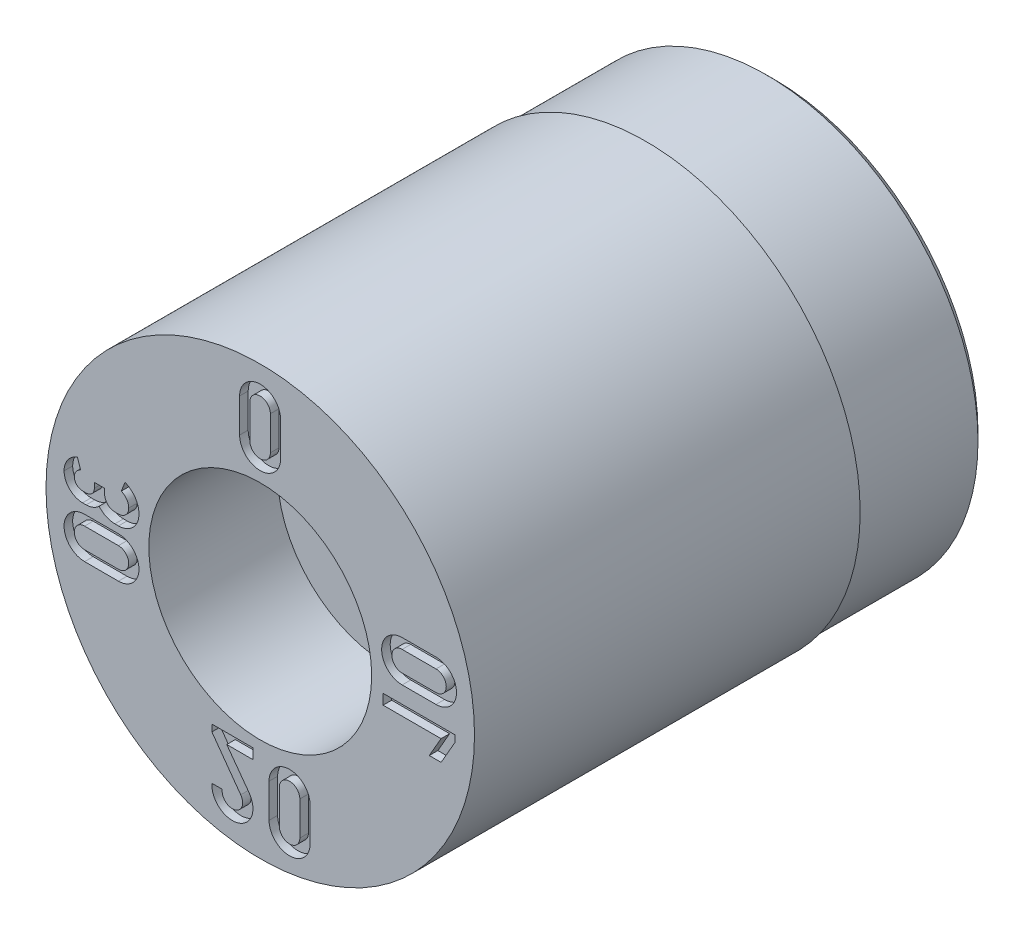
from build123d import *

# Parameters (mm, degrees)
SKETCH4_W          = 3
SKETCH4_H          = 1
CUT_EXTRUDE1_DEPTH = 0.2


with BuildPart() as part:
    # Sketch1 → Revolve1 (revolve)
    with BuildSketch(Plane(origin=(0, 0, 0), x_dir=(0, 0, -1), z_dir=(1, 0, 0)), mode=Mode.PRIVATE) as revolve1_sk:
        Polygon((0, 5), (0, 2.6), (3, 2.6), (3, 1.25), (12, 1.25), (12, 4.75), (11.75, 5), align=None)
    revolve(revolve1_sk.sketch.rotate(Axis((0, 0, 3.797909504), (0, 0, -1)), 90), axis=Axis((0, 0, 3.797909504), (0, 0, -1)))

    # Sketch4 → Cut-Revolve1 (revolve, cut)
    with BuildSketch(Plane(origin=(0, 0, 0), x_dir=(0, 0, -1), z_dir=(1, 0, 0)), mode=Mode.PRIVATE) as cut_revolve1_sk:
        with Locations((10.5, 5.435)):
            Rectangle(SKETCH4_W, SKETCH4_H)
    revolve(cut_revolve1_sk.sketch.rotate(Axis((0, 0, 0), (0, 0, -1)), 90), axis=Axis((0, 0, 0), (0, 0, -1)), mode=Mode.SUBTRACT)

    # Sketch2 → Cut-Extrude1 (cut)
    # profile 1 of 7: a face of its own
    with BuildSketch(Plane.XY):
        with BuildLine():
            Line((1.163016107, -4.120268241), (1.163083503, -3.330414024))
            ThreePointArc((1.163083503, -3.330414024), (0.684208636, -2.851569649), (0.20538668, -3.330466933))
            Line((0.20538668, -3.330466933), (0.205453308, -4.120349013))
            ThreePointArc((0.205453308, -4.120349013), (0.684275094, -4.599090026), (1.163016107, -4.120268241))
        make_face()
        with BuildLine():
            Line((0.444844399, -3.330446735), (0.444911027, -4.120328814))
            ThreePointArc((0.444911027, -4.120328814), (0.684254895, -4.359632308), (0.923558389, -4.120288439))
            Line((0.923558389, -4.120288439), (0.923625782, -3.330389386))
            ThreePointArc((0.923625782, -3.330389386), (0.684206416, -3.091027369), (0.444844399, -3.330446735))
        make_face(mode=Mode.SUBTRACT)
    # profile 2 of 7: a face of its own
    with BuildSketch(Plane.XY):
        with BuildLine():
            Line((-3.308932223, 0.312303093), (-3.392707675, 0.312310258))
            ThreePointArc((-3.392707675, 0.312310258), (-3.561908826, 0.382412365), (-3.631982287, 0.551625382))
            Line((-3.631982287, 0.551625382), (-3.631972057, 0.671282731))
            Line((-3.631972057, 0.671282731), (-3.871362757, 0.671303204))
            Line((-3.871362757, 0.671303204), (-3.871372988, 0.551674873))
            ThreePointArc((-3.871372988, 0.551674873), (-3.927465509, 0.416288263), (-4.062861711, 0.3602189))
            Line((-4.062861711, 0.3602189), (-4.14662557, 0.360226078))
            ThreePointArc((-4.14662557, 0.360226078), (-4.28196444, 0.416366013), (-4.338090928, 0.55171046))
            ThreePointArc((-4.338090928, 0.55171046), (-4.297736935, 0.677333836), (-4.191636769, 0.755771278))
            Line((-4.191636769, 0.755771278), (-4.268220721, 0.982571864))
            ThreePointArc((-4.268220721, 0.982571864), (-4.492105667, 0.816891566), (-4.577453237, 0.551768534))
            ThreePointArc((-4.577453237, 0.551768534), (-4.451310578, 0.247050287), (-4.146622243, 0.120835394))
            Line((-4.146622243, 0.120835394), (-4.062882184, 0.1208282))
            ThreePointArc((-4.062882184, 0.1208282), (-3.899350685, 0.153069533), (-3.760309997, 0.244992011))
            ThreePointArc((-3.760309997, 0.244992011), (-3.595661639, 0.118051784), (-3.392718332, 0.072919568))
            Line((-3.392718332, 0.072919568), (-3.3089122, 0.072912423))
            ThreePointArc((-3.3089122, 0.072912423), (-2.970431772, 0.21309559), (-2.830237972, 0.551571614))
            ThreePointArc((-2.830237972, 0.551571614), (-2.919396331, 0.841094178), (-3.155959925, 1.030329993))
            Line((-3.155959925, 1.030329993), (-3.243801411, 0.807742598))
            ThreePointArc((-3.243801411, 0.807742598), (-3.117245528, 0.706517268), (-3.069561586, 0.551632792))
            ThreePointArc((-3.069561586, 0.551632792), (-3.139680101, 0.382392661), (-3.308932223, 0.312303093))
        make_face()
    # profile 3 of 7: a face of its own
    with BuildSketch(Plane.XY):
        with BuildLine():
            Line((4.101373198, 1.126530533), (3.311510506, 1.126463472))
            ThreePointArc((3.311510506, 1.126463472), (2.832769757, 0.647651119), (3.311572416, 0.168900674))
            Line((3.311572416, 0.168900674), (4.101454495, 0.168967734))
            ThreePointArc((4.101454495, 0.168967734), (4.580195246, 0.647789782), (4.101373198, 1.126530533))
        make_face()
        with BuildLine():
            Line((3.311552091, 0.408291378), (4.101434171, 0.408358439))
            ThreePointArc((4.101434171, 0.408358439), (4.340804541, 0.647769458), (4.101393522, 0.887139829))
            Line((4.101393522, 0.887139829), (3.311494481, 0.887072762))
            ThreePointArc((3.311494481, 0.887072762), (3.072160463, 0.647653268), (3.311552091, 0.408291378))
        make_face(mode=Mode.SUBTRACT)
    # profile 4 of 7: a face of its own
    with BuildSketch(Plane.XY):
        Polygon((4.542593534, -0.223337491), (4.542606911, -0.380898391), (4.220361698, -0.941402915), (3.944311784, -0.941426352), (4.219449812, -0.462688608), (2.867147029, -0.462803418), (2.867126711, -0.223479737), align=None)
    # profile 5 of 7: a face of its own
    with BuildSketch(Plane.XY):
        with BuildLine():
            Line((-0.171332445, -3.081687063), (-0.171352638, -2.842293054))
            Line((-0.171352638, -2.842293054), (-1.1287814, -2.842373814))
            Line((-1.1287814, -2.842373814), (-1.128768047, -3.00067192))
            Line((-1.128768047, -3.00067192), (-0.455620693, -3.935056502))
            ThreePointArc((-0.455620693, -3.935056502), (-0.593692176, -4.307734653), (-0.886588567, -4.03910025))
            Line((-0.886588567, -4.03910025), (-1.127340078, -4.039126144))
            ThreePointArc((-1.127340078, -4.039126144), (-0.519813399, -4.535683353), (-0.261095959, -3.794924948))
            Line((-0.261095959, -3.794924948), (-0.781737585, -3.081738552))
            Line((-0.781737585, -3.081738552), (-0.171332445, -3.081687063))
        make_face()
    # profile 6 of 7: a face of its own
    with BuildSketch(Plane.XY):
        with BuildLine():
            Line((-0.481559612, 4.112168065), (-0.481492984, 3.322305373))
            ThreePointArc((-0.481492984, 3.322305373), (-0.002761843, 2.843603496), (0.475935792, 3.322338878))
            Line((0.475935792, 3.322338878), (0.476003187, 4.112248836))
            ThreePointArc((0.476003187, 4.112248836), (-0.002818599, 4.59098985), (-0.481559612, 4.112168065))
        make_face()
        with BuildLine():
            Line((0.236612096, 3.322346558), (0.236545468, 4.112228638))
            ThreePointArc((0.236545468, 4.112228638), (-0.0027984, 4.351532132), (-0.242101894, 4.112188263))
            Line((-0.242101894, 4.112188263), (-0.242169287, 3.32228921))
            ThreePointArc((-0.242169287, 3.32228921), (-0.002749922, 3.082927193), (0.236612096, 3.322346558))
        make_face(mode=Mode.SUBTRACT)
    # profile 7 of 7: a face of its own
    with BuildSketch(Plane.XY):
        with BuildLine():
            Line((-4.099374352, -0.086875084), (-3.309511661, -0.086942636))
            ThreePointArc((-3.309511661, -0.086942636), (-2.830761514, -0.565755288), (-3.309574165, -1.044505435))
            Line((-3.309574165, -1.044505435), (-4.099456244, -1.044437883))
            ThreePointArc((-4.099456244, -1.044437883), (-4.578196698, -0.565615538), (-4.099374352, -0.086875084))
        make_face()
        with BuildLine():
            Line((-3.309580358, -0.80518174), (-4.099435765, -0.804980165))
            ThreePointArc((-4.099435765, -0.804980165), (-4.338738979, -0.565636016), (-4.099394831, -0.326332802))
            Line((-4.099394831, -0.326332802), (-3.309495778, -0.326266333))
            ThreePointArc((-3.309495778, -0.326266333), (-3.070085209, -0.565766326), (-3.309580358, -0.80518174))
        make_face(mode=Mode.SUBTRACT)
    extrude(amount=-CUT_EXTRUDE1_DEPTH, mode=Mode.SUBTRACT)


solid = part.part
